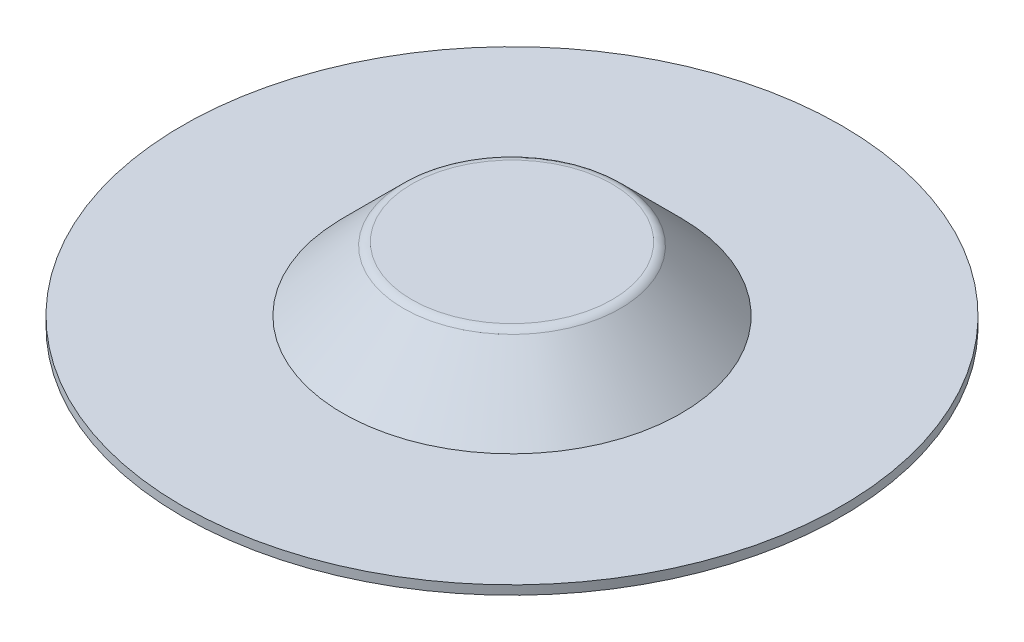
ISO-10303-21;
HEADER;
FILE_DESCRIPTION(('STEP AP214'),'2;1');
FILE_NAME('part.step','',(''),(''),'','','');
FILE_SCHEMA(('AUTOMOTIVE_DESIGN { 1 0 10303 214 1 1 1 1 }'));
ENDSEC;
DATA;
#1=APPLICATION_CONTEXT('core data for automotive mechanical design processes');
#2=APPLICATION_PROTOCOL_DEFINITION('international standard','automotive_design',2000,#1);
#3=PRODUCT_CONTEXT('',#1,'mechanical');
#4=PRODUCT('Part','Part','',(#3));
#5=PRODUCT_RELATED_PRODUCT_CATEGORY('part','',(#4));
#6=PRODUCT_DEFINITION_FORMATION('','',#4);
#7=PRODUCT_DEFINITION_CONTEXT('part definition',#1,'design');
#8=PRODUCT_DEFINITION('design','',#6,#7);
#9=PRODUCT_DEFINITION_SHAPE('','',#8);
#10=(LENGTH_UNIT() NAMED_UNIT(*) SI_UNIT(.MILLI.,.METRE.));
#11=(NAMED_UNIT(*) PLANE_ANGLE_UNIT() SI_UNIT($,.RADIAN.));
#12=(NAMED_UNIT(*) SI_UNIT($,.STERADIAN.) SOLID_ANGLE_UNIT());
#13=UNCERTAINTY_MEASURE_WITH_UNIT(LENGTH_MEASURE(1.E-05),#10,'distance_accuracy_value','');
#14=(GEOMETRIC_REPRESENTATION_CONTEXT(3) GLOBAL_UNCERTAINTY_ASSIGNED_CONTEXT((#13)) GLOBAL_UNIT_ASSIGNED_CONTEXT((#10,
#11,#12)) REPRESENTATION_CONTEXT('',''));
#15=CARTESIAN_POINT('',(0.,0.,0.));
#16=DIRECTION('',(0.,0.,1.));
#17=DIRECTION('',(1.,0.,0.));
#18=AXIS2_PLACEMENT_3D('',#15,#16,#17);
#19=CARTESIAN_POINT('',(-13.5156359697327,8.636,0.));
#20=DIRECTION('',(0.,-1.,0.));
#21=DIRECTION('',(0.,0.,-1.));
#22=AXIS2_PLACEMENT_3D('',#19,#20,#21);
#23=PLANE('',#22);
#24=CARTESIAN_POINT('',(0.,8.636,0.));
#25=DIRECTION('',(0.,-1.,0.));
#26=DIRECTION('',(0.,0.,1.));
#27=AXIS2_PLACEMENT_3D('',#24,#25,#26);
#28=CIRCLE('',#27,13.5156359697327);
#29=CARTESIAN_POINT('',(0.,8.636,13.5156359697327));
#30=VERTEX_POINT('',#29);
#31=CARTESIAN_POINT('',(0.,8.636,-13.5156359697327));
#32=VERTEX_POINT('',#31);
#33=EDGE_CURVE('E46',#30,#32,#28,.T.);
#34=ORIENTED_EDGE('',*,*,#33,.F.);
#35=CARTESIAN_POINT('',(0.,8.636,0.));
#36=DIRECTION('',(0.,-1.,0.));
#37=DIRECTION('',(0.,0.,-1.));
#38=AXIS2_PLACEMENT_3D('',#35,#36,#37);
#39=CIRCLE('',#38,13.5156359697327);
#40=EDGE_CURVE('E48',#32,#30,#39,.T.);
#41=ORIENTED_EDGE('',*,*,#40,.F.);
#42=EDGE_LOOP('',(#34,#41));
#43=FACE_BOUND('',#42,.T.);
#44=ADVANCED_FACE('F18',(#43),#23,.F.);
#45=CARTESIAN_POINT('',(0.,7.0485,0.));
#46=DIRECTION('',(0.,-1.,0.));
#47=DIRECTION('',(0.,0.,-1.));
#48=AXIS2_PLACEMENT_3D('',#45,#46,#47);
#49=TOROIDAL_SURFACE('',#48,13.5156359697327,1.5875);
#50=CARTESIAN_POINT('',(0.,8.17103201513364,0.));
#51=DIRECTION('',(0.,-1.,0.));
#52=DIRECTION('',(0.,0.,-1.));
#53=AXIS2_PLACEMENT_3D('',#50,#51,#52);
#54=CIRCLE('',#53,14.6381679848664);
#55=CARTESIAN_POINT('',(0.,8.17103201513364,-14.6381679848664));
#56=VERTEX_POINT('',#55);
#57=EDGE_CURVE('E53',#56,#56,#54,.T.);
#58=ORIENTED_EDGE('',*,*,#57,.F.);
#59=EDGE_LOOP('',(#58));
#60=FACE_BOUND('',#59,.T.);
#61=ORIENTED_EDGE('',*,*,#40,.T.);
#62=ORIENTED_EDGE('',*,*,#33,.T.);
#63=EDGE_LOOP('',(#61,#62));
#64=FACE_BOUND('',#63,.T.);
#65=ADVANCED_FACE('F50',(#60,#64),#49,.T.);
#66=CARTESIAN_POINT('',(-13.5156359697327,7.4168,0.));
#67=DIRECTION('',(0.,1.,0.));
#68=DIRECTION('',(0.,0.,1.));
#69=AXIS2_PLACEMENT_3D('',#66,#67,#68);
#70=PLANE('',#69);
#71=CARTESIAN_POINT('',(0.,7.41679999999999,0.));
#72=DIRECTION('',(0.,1.,0.));
#73=DIRECTION('',(0.,0.,-1.));
#74=AXIS2_PLACEMENT_3D('',#71,#72,#73);
#75=CIRCLE('',#74,13.5156359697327);
#76=CARTESIAN_POINT('',(0.,7.41679999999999,13.5156359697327));
#77=VERTEX_POINT('',#76);
#78=CARTESIAN_POINT('',(0.,7.41679999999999,-13.5156359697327));
#79=VERTEX_POINT('',#78);
#80=EDGE_CURVE('E37',#77,#79,#75,.F.);
#81=ORIENTED_EDGE('',*,*,#80,.T.);
#82=CARTESIAN_POINT('',(0.,7.41679999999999,0.));
#83=DIRECTION('',(0.,1.,0.));
#84=DIRECTION('',(0.,0.,1.));
#85=AXIS2_PLACEMENT_3D('',#82,#83,#84);
#86=CIRCLE('',#85,13.5156359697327);
#87=EDGE_CURVE('E100',#79,#77,#86,.F.);
#88=ORIENTED_EDGE('',*,*,#87,.T.);
#89=EDGE_LOOP('',(#81,#88));
#90=FACE_BOUND('',#89,.T.);
#91=ADVANCED_FACE('F79',(#90),#70,.F.);
#92=CARTESIAN_POINT('',(0.,0.,0.));
#93=DIRECTION('',(0.,-1.,0.));
#94=DIRECTION('',(0.,0.,-1.));
#95=AXIS2_PLACEMENT_3D('',#92,#93,#94);
#96=CONICAL_SURFACE('',#95,22.8092,0.785398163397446);
#97=CARTESIAN_POINT('',(0.,0.,0.));
#98=DIRECTION('',(0.,-1.,0.));
#99=DIRECTION('',(0.,0.,-1.));
#100=AXIS2_PLACEMENT_3D('',#97,#98,#99);
#101=CIRCLE('',#100,22.8092);
#102=CARTESIAN_POINT('',(0.,0.,-22.8092));
#103=VERTEX_POINT('',#102);
#104=EDGE_CURVE('E98',#103,#103,#101,.F.);
#105=ORIENTED_EDGE('',*,*,#104,.T.);
#106=EDGE_LOOP('',(#105));
#107=FACE_BOUND('',#106,.T.);
#108=ORIENTED_EDGE('',*,*,#57,.T.);
#109=EDGE_LOOP('',(#108));
#110=FACE_BOUND('',#109,.T.);
#111=ADVANCED_FACE('F116',(#107,#110),#96,.T.);
#112=CARTESIAN_POINT('',(0.,7.0485,0.));
#113=DIRECTION('',(0.,-1.,0.));
#114=DIRECTION('',(0.,0.,-1.));
#115=AXIS2_PLACEMENT_3D('',#112,#113,#114);
#116=TOROIDAL_SURFACE('',#115,13.5156359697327,0.368299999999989);
#117=ORIENTED_EDGE('',*,*,#87,.F.);
#118=ORIENTED_EDGE('',*,*,#80,.F.);
#119=EDGE_LOOP('',(#117,#118));
#120=FACE_BOUND('',#119,.T.);
#121=CARTESIAN_POINT('',(0.,7.30892742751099,0.));
#122=DIRECTION('',(0.,-1.,0.));
#123=DIRECTION('',(0.,0.,-1.));
#124=AXIS2_PLACEMENT_3D('',#121,#122,#123);
#125=CIRCLE('',#124,13.7760633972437);
#126=CARTESIAN_POINT('',(0.,7.30892742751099,-13.7760633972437));
#127=VERTEX_POINT('',#126);
#128=EDGE_CURVE('E97',#127,#127,#125,.T.);
#129=ORIENTED_EDGE('',*,*,#128,.T.);
#130=EDGE_LOOP('',(#129));
#131=FACE_BOUND('',#130,.T.);
#132=ADVANCED_FACE('F105',(#120,#131),#116,.F.);
#133=CARTESIAN_POINT('',(-44.45,0.,0.));
#134=DIRECTION('',(0.,-1.,0.));
#135=DIRECTION('',(0.,0.,-1.));
#136=AXIS2_PLACEMENT_3D('',#133,#134,#135);
#137=PLANE('',#136);
#138=ORIENTED_EDGE('',*,*,#104,.F.);
#139=EDGE_LOOP('',(#138));
#140=FACE_BOUND('',#139,.T.);
#141=CARTESIAN_POINT('',(0.,0.,0.));
#142=DIRECTION('',(0.,-1.,0.));
#143=DIRECTION('',(0.,0.,-1.));
#144=AXIS2_PLACEMENT_3D('',#141,#142,#143);
#145=CIRCLE('',#144,44.45);
#146=CARTESIAN_POINT('',(0.,0.,-44.45));
#147=VERTEX_POINT('',#146);
#148=EDGE_CURVE('E94',#147,#147,#145,.T.);
#149=ORIENTED_EDGE('',*,*,#148,.F.);
#150=EDGE_LOOP('',(#149));
#151=FACE_BOUND('',#150,.T.);
#152=ADVANCED_FACE('F115',(#140,#151),#137,.F.);
#153=CARTESIAN_POINT('',(0.,-1.2192,0.));
#154=DIRECTION('',(0.,-1.,0.));
#155=DIRECTION('',(1.,0.,0.));
#156=AXIS2_PLACEMENT_3D('',#153,#154,#155);
#157=CONICAL_SURFACE('',#156,22.3041908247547,0.785398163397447);
#158=ORIENTED_EDGE('',*,*,#128,.F.);
#159=EDGE_LOOP('',(#158));
#160=FACE_BOUND('',#159,.T.);
#161=CARTESIAN_POINT('',(0.,-1.2192,0.));
#162=DIRECTION('',(0.,-1.,0.));
#163=DIRECTION('',(1.,0.,0.));
#164=AXIS2_PLACEMENT_3D('',#161,#162,#163);
#165=CIRCLE('',#164,22.3041908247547);
#166=CARTESIAN_POINT('',(22.3041908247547,-1.2192,0.));
#167=VERTEX_POINT('',#166);
#168=EDGE_CURVE('E29',#167,#167,#165,.T.);
#169=ORIENTED_EDGE('',*,*,#168,.T.);
#170=EDGE_LOOP('',(#169));
#171=FACE_BOUND('',#170,.T.);
#172=ADVANCED_FACE('F166',(#160,#171),#157,.F.);
#173=CARTESIAN_POINT('',(0.,0.,0.));
#174=DIRECTION('',(0.,-1.,0.));
#175=DIRECTION('',(0.,0.,-1.));
#176=AXIS2_PLACEMENT_3D('',#173,#174,#175);
#177=CYLINDRICAL_SURFACE('',#176,44.45);
#178=CARTESIAN_POINT('',(0.,-1.2192,0.));
#179=DIRECTION('',(0.,-1.,0.));
#180=DIRECTION('',(0.,0.,-1.));
#181=AXIS2_PLACEMENT_3D('',#178,#179,#180);
#182=CIRCLE('',#181,44.45);
#183=CARTESIAN_POINT('',(0.,-1.2192,-44.45));
#184=VERTEX_POINT('',#183);
#185=EDGE_CURVE('E11',#184,#184,#182,.F.);
#186=ORIENTED_EDGE('',*,*,#185,.T.);
#187=EDGE_LOOP('',(#186));
#188=FACE_BOUND('',#187,.T.);
#189=ORIENTED_EDGE('',*,*,#148,.T.);
#190=EDGE_LOOP('',(#189));
#191=FACE_BOUND('',#190,.T.);
#192=ADVANCED_FACE('F160',(#188,#191),#177,.T.);
#193=CARTESIAN_POINT('',(-44.45,-1.2192,0.));
#194=DIRECTION('',(0.,1.,0.));
#195=DIRECTION('',(0.,0.,1.));
#196=AXIS2_PLACEMENT_3D('',#193,#194,#195);
#197=PLANE('',#196);
#198=ORIENTED_EDGE('',*,*,#185,.F.);
#199=EDGE_LOOP('',(#198));
#200=FACE_BOUND('',#199,.T.);
#201=ORIENTED_EDGE('',*,*,#168,.F.);
#202=EDGE_LOOP('',(#201));
#203=FACE_BOUND('',#202,.T.);
#204=ADVANCED_FACE('F158',(#200,#203),#197,.F.);
#205=CLOSED_SHELL('',(#44,#65,#91,#111,#132,#152,#172,#192,#204));
#206=MANIFOLD_SOLID_BREP('B1',#205);
#207=ADVANCED_BREP_SHAPE_REPRESENTATION('',(#18,#206),#14);
#208=SHAPE_DEFINITION_REPRESENTATION(#9,#207);
ENDSEC;
END-ISO-10303-21;
